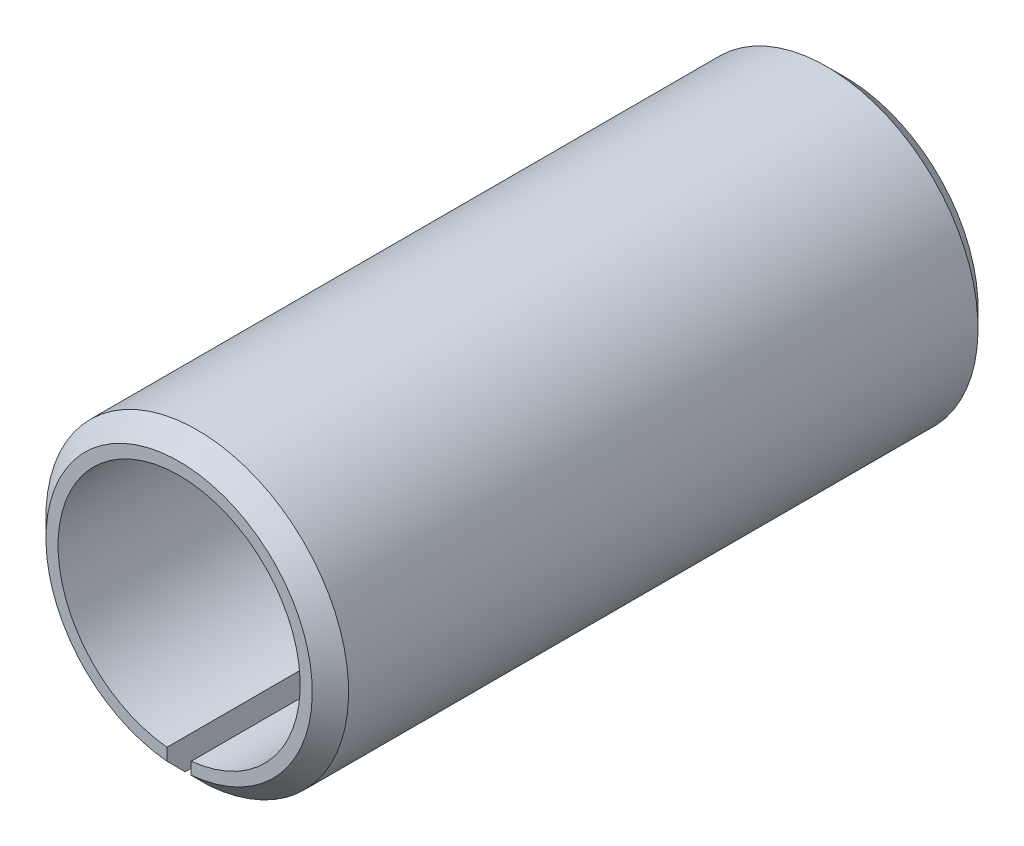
from build123d import *

# Parameters (mm, degrees)
EXTRUSION1_DEPTH = 11
CHANFREIN1_SIZE  = 0.3


with BuildPart() as part:
    # Esquisse1 → Extrusion1 (new body)
    with BuildSketch(Plane.XY):
        with BuildLine():
            Line((-0.2, -1.989974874), (-0.2, -2.491987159))
            ThreePointArc((-0.2, -2.491987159), (0, 2.5), (0.2, -2.491987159))
            Line((0.2, -2.491987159), (0.2, -1.989974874))
            ThreePointArc((0.2, -1.989974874), (0, 2), (-0.2, -1.989974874))
        make_face()
    extrude(amount=EXTRUSION1_DEPTH)

    # Chanfrein1
    chanfrein1_edges = [part.edges().sort_by_distance(p)[0] for p in [
        (0, 2.5, 11),
        (0, 2.5, 0),
    ]]
    chamfer(chanfrein1_edges, length=CHANFREIN1_SIZE)


solid = part.part
